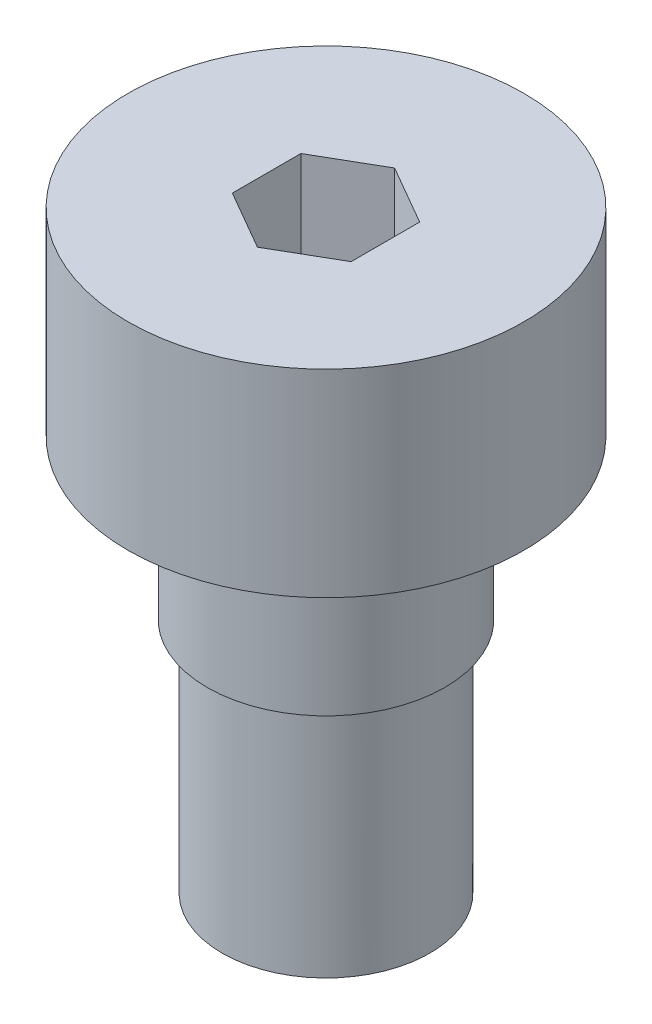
from build123d import *

# Parameters (mm, degrees)
SKETCH1_R           = 3.96875
BOSS_EXTRUDE1_DEPTH = 3.96875
SKETCH2_R           = 2.38125
BOSS_EXTRUDE2_DEPTH = 3.175
SKETCH3_R           = 2.0828
BOSS_EXTRUDE3_DEPTH = 4.7625
CUT_EXTRUDE1_DEPTH  = 3.96875


with BuildPart() as part:
    # Sketch1 → Boss-Extrude1 (new body)
    with BuildSketch(Plane(origin=(0, 0, 0), x_dir=(1, 0, 0), z_dir=(0, 1, 0))):
        with Locations(Location((0, 0, 0), (0, 0, 270))):
            Circle(SKETCH1_R)
    extrude(amount=BOSS_EXTRUDE1_DEPTH)

    # Sketch2 → Boss-Extrude2 (add)
    with BuildSketch(Plane(origin=(0, 0, 0), x_dir=(1, 0, 0), z_dir=(0, 1, 0))):
        with Locations(Location((0, 0, 0), (0, 0, 270))):
            Circle(SKETCH2_R)
    extrude(amount=-BOSS_EXTRUDE2_DEPTH)

    # Sketch3 → Boss-Extrude3 (add)
    with BuildSketch(Plane.XZ.offset(3.175)):
        with Locations(Location((0, 0, 0), (0, 0, 90))):
            Circle(SKETCH3_R)
    extrude(amount=BOSS_EXTRUDE3_DEPTH)

    # Sketch4 → Cut-Extrude1 (cut)
    with BuildSketch(Plane(origin=(0, 3.96875, 0), x_dir=(1, 0, 0), z_dir=(0, 1, 0))):
        Polygon((0, 1.374815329), (-1.190625, 0.687407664), (-1.190625, -0.687407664), (0, -1.374815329), (1.190625, -0.687407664), (1.190625, 0.687407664), align=None)
    extrude(amount=-CUT_EXTRUDE1_DEPTH, mode=Mode.SUBTRACT)


solid = part.part
